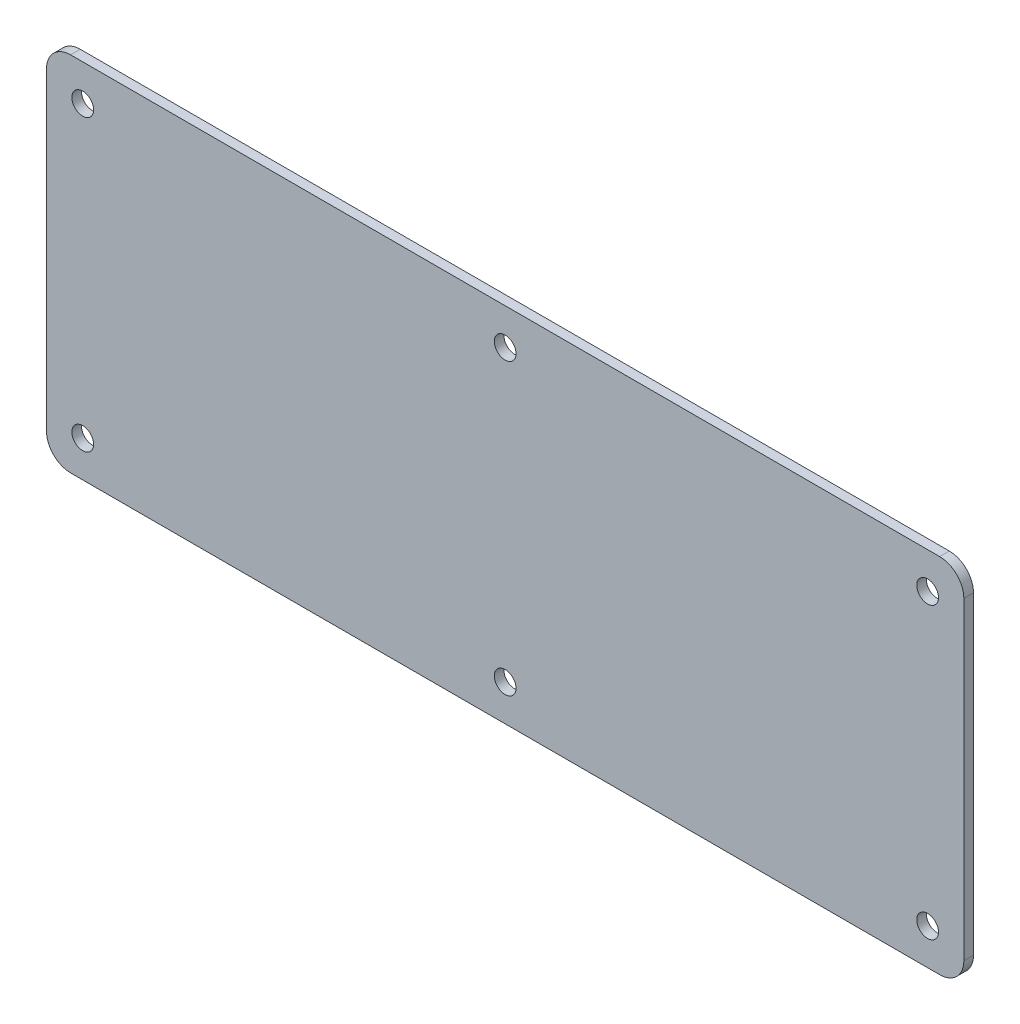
from build123d import *

# Parameters (mm, degrees)
ESQUISSE1_R      = 4.5
EXTRUSION1_DEPTH = 4


with BuildPart() as part:
    # Esquisse1 → Extrusion1 (new body)
    with BuildSketch(Plane.XY):
        with BuildLine():
            Line((-0.033156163, 55.284738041), (359.966843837, 55.284738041))
            ThreePointArc((359.966843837, 55.284738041), (367.037911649, 52.355805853), (369.966843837, 45.284738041))
            Line((369.966843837, 45.284738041), (369.966843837, -84.715261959))
            ThreePointArc((369.966843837, -84.715261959), (367.037911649, -91.786329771), (359.966843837, -94.715261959))
            Line((359.966843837, -94.715261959), (-0.033156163, -94.715261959))
            ThreePointArc((-0.033156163, -94.715261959), (-7.104223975, -91.786329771), (-10.033156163, -84.715261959))
            Line((-10.033156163, -84.715261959), (-10.033156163, 45.284738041))
            ThreePointArc((-10.033156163, 45.284738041), (-7.104223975, 52.355805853), (-0.033156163, 55.284738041))
        make_face()
        with Locations((4.966843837, 40.284738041)):
            Circle(ESQUISSE1_R, mode=Mode.SUBTRACT)
        with Locations((179.966843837, 40.284738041)):
            Circle(ESQUISSE1_R, mode=Mode.SUBTRACT)
        with Locations((354.966843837, 40.284738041)):
            Circle(ESQUISSE1_R, mode=Mode.SUBTRACT)
        with Locations((4.966843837, -79.715261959)):
            Circle(ESQUISSE1_R, mode=Mode.SUBTRACT)
        with Locations((179.966843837, -79.715261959)):
            Circle(ESQUISSE1_R, mode=Mode.SUBTRACT)
        with Locations((354.966843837, -79.715261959)):
            Circle(ESQUISSE1_R, mode=Mode.SUBTRACT)
    extrude(amount=EXTRUSION1_DEPTH)


solid = part.part
